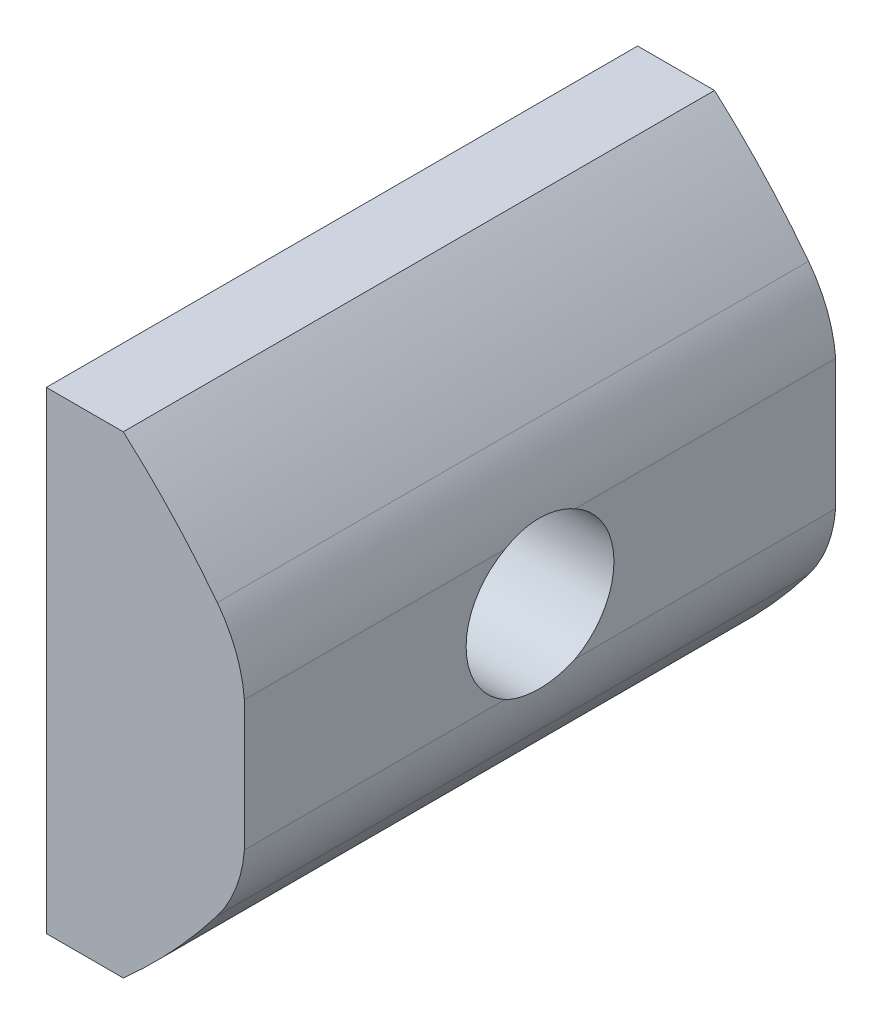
ISO-10303-21;
HEADER;
FILE_DESCRIPTION(('STEP AP214'),'2;1');
FILE_NAME('part.step','',(''),(''),'','','');
FILE_SCHEMA(('AUTOMOTIVE_DESIGN { 1 0 10303 214 1 1 1 1 }'));
ENDSEC;
DATA;
#1=APPLICATION_CONTEXT('core data for automotive mechanical design processes');
#2=APPLICATION_PROTOCOL_DEFINITION('international standard','automotive_design',2000,#1);
#3=PRODUCT_CONTEXT('',#1,'mechanical');
#4=PRODUCT('Part','Part','',(#3));
#5=PRODUCT_RELATED_PRODUCT_CATEGORY('part','',(#4));
#6=PRODUCT_DEFINITION_FORMATION('','',#4);
#7=PRODUCT_DEFINITION_CONTEXT('part definition',#1,'design');
#8=PRODUCT_DEFINITION('design','',#6,#7);
#9=PRODUCT_DEFINITION_SHAPE('','',#8);
#10=(LENGTH_UNIT() NAMED_UNIT(*) SI_UNIT(.MILLI.,.METRE.));
#11=(NAMED_UNIT(*) PLANE_ANGLE_UNIT() SI_UNIT($,.RADIAN.));
#12=(NAMED_UNIT(*) SI_UNIT($,.STERADIAN.) SOLID_ANGLE_UNIT());
#13=UNCERTAINTY_MEASURE_WITH_UNIT(LENGTH_MEASURE(1.E-05),#10,'distance_accuracy_value','');
#14=(GEOMETRIC_REPRESENTATION_CONTEXT(3) GLOBAL_UNCERTAINTY_ASSIGNED_CONTEXT((#13)) GLOBAL_UNIT_ASSIGNED_CONTEXT((#10,
#11,#12)) REPRESENTATION_CONTEXT('',''));
#15=CARTESIAN_POINT('',(0.,0.,0.));
#16=DIRECTION('',(0.,0.,1.));
#17=DIRECTION('',(1.,0.,0.));
#18=AXIS2_PLACEMENT_3D('',#15,#16,#17);
#19=CARTESIAN_POINT('',(4.,2.2,10.));
#20=DIRECTION('',(-1.,0.,0.));
#21=DIRECTION('',(0.,0.,1.));
#22=AXIS2_PLACEMENT_3D('',#19,#20,#21);
#23=PLANE('',#22);
#24=DIRECTION('',(0.,0.,-1.));
#25=VECTOR('',#24,1.);
#26=CARTESIAN_POINT('',(4.,2.2,10.));
#27=LINE('',#26,#25);
#28=CARTESIAN_POINT('',(4.,2.20000000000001,-1.18743420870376));
#29=VERTEX_POINT('',#28);
#30=CARTESIAN_POINT('',(4.,2.2,-10.));
#31=VERTEX_POINT('',#30);
#32=EDGE_CURVE('E141',#29,#31,#27,.T.);
#33=ORIENTED_EDGE('',*,*,#32,.F.);
#34=CARTESIAN_POINT('',(4.,0.,0.));
#35=DIRECTION('',(-1.,0.,0.));
#36=DIRECTION('',(0.,0.,1.));
#37=AXIS2_PLACEMENT_3D('',#34,#35,#36);
#38=CIRCLE('',#37,2.5);
#39=CARTESIAN_POINT('',(4.,-2.20000000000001,-1.18743420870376));
#40=VERTEX_POINT('',#39);
#41=EDGE_CURVE('E122',#29,#40,#38,.T.);
#42=ORIENTED_EDGE('',*,*,#41,.T.);
#43=DIRECTION('',(0.,0.,-1.));
#44=VECTOR('',#43,1.);
#45=CARTESIAN_POINT('',(4.,-2.2,10.));
#46=LINE('',#45,#44);
#47=CARTESIAN_POINT('',(4.,-2.2,-10.));
#48=VERTEX_POINT('',#47);
#49=EDGE_CURVE('E140',#40,#48,#46,.T.);
#50=ORIENTED_EDGE('',*,*,#49,.T.);
#51=DIRECTION('',(0.,1.,0.));
#52=VECTOR('',#51,1.);
#53=CARTESIAN_POINT('',(4.,2.2,-10.));
#54=LINE('',#53,#52);
#55=EDGE_CURVE('E273',#48,#31,#54,.T.);
#56=ORIENTED_EDGE('',*,*,#55,.T.);
#57=EDGE_LOOP('',(#33,#42,#50,#56));
#58=FACE_BOUND('',#57,.T.);
#59=ADVANCED_FACE('F29',(#58),#23,.F.);
#60=CARTESIAN_POINT('',(-3.,8.,10.));
#61=DIRECTION('',(0.,-1.,0.));
#62=DIRECTION('',(0.,0.,-1.));
#63=AXIS2_PLACEMENT_3D('',#60,#61,#62);
#64=PLANE('',#63);
#65=DIRECTION('',(-1.,0.,0.));
#66=VECTOR('',#65,1.);
#67=CARTESIAN_POINT('',(-3.,8.,-10.));
#68=LINE('',#67,#66);
#69=CARTESIAN_POINT('',(-0.0973372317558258,8.,-10.));
#70=VERTEX_POINT('',#69);
#71=CARTESIAN_POINT('',(-2.7,8.,-10.));
#72=VERTEX_POINT('',#71);
#73=EDGE_CURVE('E260',#70,#72,#68,.T.);
#74=ORIENTED_EDGE('',*,*,#73,.T.);
#75=DIRECTION('',(0.,0.,1.));
#76=VECTOR('',#75,1.);
#77=CARTESIAN_POINT('',(-2.7,8.,10.));
#78=LINE('',#77,#76);
#79=CARTESIAN_POINT('',(-2.7,8.,10.));
#80=VERTEX_POINT('',#79);
#81=EDGE_CURVE('E163',#72,#80,#78,.T.);
#82=ORIENTED_EDGE('',*,*,#81,.T.);
#83=DIRECTION('',(-1.,0.,0.));
#84=VECTOR('',#83,1.);
#85=CARTESIAN_POINT('',(-3.,8.,10.));
#86=LINE('',#85,#84);
#87=CARTESIAN_POINT('',(-0.0973372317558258,8.,10.));
#88=VERTEX_POINT('',#87);
#89=EDGE_CURVE('E280',#88,#80,#86,.T.);
#90=ORIENTED_EDGE('',*,*,#89,.F.);
#91=DIRECTION('',(0.,0.,-1.));
#92=VECTOR('',#91,1.);
#93=CARTESIAN_POINT('',(-0.0973372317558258,8.,10.));
#94=LINE('',#93,#92);
#95=EDGE_CURVE('E293',#88,#70,#94,.T.);
#96=ORIENTED_EDGE('',*,*,#95,.T.);
#97=EDGE_LOOP('',(#74,#82,#90,#96));
#98=FACE_BOUND('',#97,.T.);
#99=ADVANCED_FACE('F31',(#98),#64,.F.);
#100=CARTESIAN_POINT('',(-3.,8.,10.));
#101=DIRECTION('',(1.,0.,0.));
#102=DIRECTION('',(0.,0.,-1.));
#103=AXIS2_PLACEMENT_3D('',#100,#101,#102);
#104=PLANE('',#103);
#105=CARTESIAN_POINT('',(-3.,0.,0.));
#106=DIRECTION('',(-1.,0.,0.));
#107=DIRECTION('',(0.,0.,1.));
#108=AXIS2_PLACEMENT_3D('',#105,#106,#107);
#109=CIRCLE('',#108,2.5);
#110=CARTESIAN_POINT('',(-3.,0.,2.5));
#111=VERTEX_POINT('',#110);
#112=EDGE_CURVE('E240',#111,#111,#109,.T.);
#113=ORIENTED_EDGE('',*,*,#112,.F.);
#114=EDGE_LOOP('',(#113));
#115=FACE_BOUND('',#114,.T.);
#116=DIRECTION('',(0.,1.,0.));
#117=VECTOR('',#116,1.);
#118=CARTESIAN_POINT('',(-3.,8.,9.7));
#119=LINE('',#118,#117);
#120=CARTESIAN_POINT('',(-3.,-7.7,9.7));
#121=VERTEX_POINT('',#120);
#122=CARTESIAN_POINT('',(-3.,7.7,9.7));
#123=VERTEX_POINT('',#122);
#124=EDGE_CURVE('E158',#121,#123,#119,.T.);
#125=ORIENTED_EDGE('',*,*,#124,.T.);
#126=DIRECTION('',(0.,0.,-1.));
#127=VECTOR('',#126,1.);
#128=CARTESIAN_POINT('',(-3.,7.7,10.));
#129=LINE('',#128,#127);
#130=CARTESIAN_POINT('',(-3.,7.7,-9.7));
#131=VERTEX_POINT('',#130);
#132=EDGE_CURVE('E160',#123,#131,#129,.T.);
#133=ORIENTED_EDGE('',*,*,#132,.T.);
#134=DIRECTION('',(0.,-1.,0.));
#135=VECTOR('',#134,1.);
#136=CARTESIAN_POINT('',(-3.,8.,-9.7));
#137=LINE('',#136,#135);
#138=CARTESIAN_POINT('',(-3.,-7.7,-9.7));
#139=VERTEX_POINT('',#138);
#140=EDGE_CURVE('E154',#131,#139,#137,.T.);
#141=ORIENTED_EDGE('',*,*,#140,.T.);
#142=DIRECTION('',(0.,0.,1.));
#143=VECTOR('',#142,1.);
#144=CARTESIAN_POINT('',(-3.,-7.7,10.));
#145=LINE('',#144,#143);
#146=EDGE_CURVE('E156',#139,#121,#145,.T.);
#147=ORIENTED_EDGE('',*,*,#146,.T.);
#148=EDGE_LOOP('',(#125,#133,#141,#147));
#149=FACE_BOUND('',#148,.T.);
#150=ADVANCED_FACE('F214',(#115,#149),#104,.F.);
#151=CARTESIAN_POINT('',(-3.,-8.,10.));
#152=DIRECTION('',(0.,1.,0.));
#153=DIRECTION('',(0.,0.,1.));
#154=AXIS2_PLACEMENT_3D('',#151,#152,#153);
#155=PLANE('',#154);
#156=DIRECTION('',(1.,0.,0.));
#157=VECTOR('',#156,1.);
#158=CARTESIAN_POINT('',(-3.,-8.,10.));
#159=LINE('',#158,#157);
#160=CARTESIAN_POINT('',(-2.7,-8.,10.));
#161=VERTEX_POINT('',#160);
#162=CARTESIAN_POINT('',(-0.0973372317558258,-8.,10.));
#163=VERTEX_POINT('',#162);
#164=EDGE_CURVE('E283',#161,#163,#159,.T.);
#165=ORIENTED_EDGE('',*,*,#164,.F.);
#166=DIRECTION('',(0.,0.,-1.));
#167=VECTOR('',#166,1.);
#168=CARTESIAN_POINT('',(-2.7,-8.,10.));
#169=LINE('',#168,#167);
#170=CARTESIAN_POINT('',(-2.7,-8.,-10.));
#171=VERTEX_POINT('',#170);
#172=EDGE_CURVE('E55',#161,#171,#169,.T.);
#173=ORIENTED_EDGE('',*,*,#172,.T.);
#174=DIRECTION('',(1.,0.,0.));
#175=VECTOR('',#174,1.);
#176=CARTESIAN_POINT('',(-3.,-8.,-10.));
#177=LINE('',#176,#175);
#178=CARTESIAN_POINT('',(-0.0973372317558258,-8.,-10.));
#179=VERTEX_POINT('',#178);
#180=EDGE_CURVE('E263',#171,#179,#177,.T.);
#181=ORIENTED_EDGE('',*,*,#180,.T.);
#182=DIRECTION('',(0.,0.,-1.));
#183=VECTOR('',#182,1.);
#184=CARTESIAN_POINT('',(-0.0973372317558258,-8.,10.));
#185=LINE('',#184,#183);
#186=EDGE_CURVE('E151',#163,#179,#185,.T.);
#187=ORIENTED_EDGE('',*,*,#186,.F.);
#188=EDGE_LOOP('',(#165,#173,#181,#187));
#189=FACE_BOUND('',#188,.T.);
#190=ADVANCED_FACE('F226',(#189),#155,.F.);
#191=CARTESIAN_POINT('',(-16.3500000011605,10.3330562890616,10.));
#192=DIRECTION('',(0.,0.,-1.));
#193=DIRECTION('',(-1.,0.,0.));
#194=AXIS2_PLACEMENT_3D('',#191,#192,#193);
#195=CYLINDRICAL_SURFACE('',#194,24.4999999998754);
#196=CARTESIAN_POINT('',(-16.3500000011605,10.3330562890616,-10.));
#197=DIRECTION('',(0.,0.,1.));
#198=DIRECTION('',(-1.,0.,0.));
#199=AXIS2_PLACEMENT_3D('',#196,#197,#198);
#200=CIRCLE('',#199,24.4999999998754);
#201=CARTESIAN_POINT('',(3.08330765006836,-4.58661373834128,-10.));
#202=VERTEX_POINT('',#201);
#203=EDGE_CURVE('E268',#179,#202,#200,.T.);
#204=ORIENTED_EDGE('',*,*,#203,.T.);
#205=DIRECTION('',(0.,0.,-1.));
#206=VECTOR('',#205,1.);
#207=CARTESIAN_POINT('',(3.08330765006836,-4.58661373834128,10.));
#208=LINE('',#207,#206);
#209=CARTESIAN_POINT('',(3.08330765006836,-4.58661373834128,10.));
#210=VERTEX_POINT('',#209);
#211=EDGE_CURVE('E148',#210,#202,#208,.T.);
#212=ORIENTED_EDGE('',*,*,#211,.F.);
#213=CARTESIAN_POINT('',(-16.3500000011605,10.3330562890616,10.));
#214=DIRECTION('',(0.,0.,1.));
#215=DIRECTION('',(-1.,0.,0.));
#216=AXIS2_PLACEMENT_3D('',#213,#214,#215);
#217=CIRCLE('',#216,24.4999999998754);
#218=EDGE_CURVE('E285',#163,#210,#217,.T.);
#219=ORIENTED_EDGE('',*,*,#218,.F.);
#220=ORIENTED_EDGE('',*,*,#186,.T.);
#221=EDGE_LOOP('',(#204,#212,#219,#220));
#222=FACE_BOUND('',#221,.T.);
#223=ADVANCED_FACE('F221',(#222),#195,.T.);
#224=CARTESIAN_POINT('',(-0.486075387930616,-1.84626618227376,10.));
#225=DIRECTION('',(0.,0.,-1.));
#226=DIRECTION('',(-1.,0.,0.));
#227=AXIS2_PLACEMENT_3D('',#224,#225,#226);
#228=CYLINDRICAL_SURFACE('',#227,4.5);
#229=ORIENTED_EDGE('',*,*,#49,.F.);
#230=CARTESIAN_POINT('',(3.61774005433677,0.,2.5));
#231=CARTESIAN_POINT('',(3.58399671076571,0.0750027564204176,2.50000013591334));
#232=CARTESIAN_POINT('',(3.54818944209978,0.149082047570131,2.49662026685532));
#233=CARTESIAN_POINT('',(3.4728081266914,0.294758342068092,2.48364134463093));
#234=CARTESIAN_POINT('',(3.43323168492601,0.366353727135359,2.47403831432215));
#235=CARTESIAN_POINT('',(3.30924440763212,0.576966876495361,2.4366883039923));
#236=CARTESIAN_POINT('',(3.2197044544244,0.711527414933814,2.4004045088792));
#237=CARTESIAN_POINT('',(3.00644665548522,0.998355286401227,2.29826500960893));
#238=CARTESIAN_POINT('',(2.87980218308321,1.14653933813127,2.22726129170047));
#239=CARTESIAN_POINT('',(2.61545423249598,1.41973365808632,2.06392073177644));
#240=CARTESIAN_POINT('',(2.47772610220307,1.54469010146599,1.97153542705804));
#241=CARTESIAN_POINT('',(2.24480976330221,1.7323157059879,1.80523741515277));
#242=CARTESIAN_POINT('',(2.15142435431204,1.80156167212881,1.73602190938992));
#243=CARTESIAN_POINT('',(1.96297176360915,1.93066459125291,1.59121224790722));
#244=CARTESIAN_POINT('',(1.86790348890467,1.99051517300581,1.51561381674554));
#245=CARTESIAN_POINT('',(1.67777220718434,2.10086176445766,1.3585181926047));
#246=CARTESIAN_POINT('',(1.58270989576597,2.15138289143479,1.27703768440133));
#247=CARTESIAN_POINT('',(1.39423187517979,2.24340000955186,1.10747131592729));
#248=CARTESIAN_POINT('',(1.30081446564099,2.28490589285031,1.01939283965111));
#249=CARTESIAN_POINT('',(1.15712646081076,2.34338518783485,0.872872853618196));
#250=CARTESIAN_POINT('',(1.10508906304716,2.36337668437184,0.817364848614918));
#251=CARTESIAN_POINT('',(1.00427984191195,2.40010871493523,0.702242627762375));
#252=CARTESIAN_POINT('',(0.955511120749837,2.41684618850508,0.642624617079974));
#253=CARTESIAN_POINT('',(0.872669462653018,2.44387935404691,0.529333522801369));
#254=CARTESIAN_POINT('',(0.837544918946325,2.4547937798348,0.476591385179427));
#255=CARTESIAN_POINT('',(0.774673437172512,2.47363878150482,0.366351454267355));
#256=CARTESIAN_POINT('',(0.746899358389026,2.48158038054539,0.308872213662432));
#257=CARTESIAN_POINT('',(0.712256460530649,2.4912673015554,0.212023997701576));
#258=CARTESIAN_POINT('',(0.701456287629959,2.49422110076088,0.174221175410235));
#259=CARTESIAN_POINT('',(0.686073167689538,2.49840106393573,0.0973003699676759));
#260=CARTESIAN_POINT('',(0.681476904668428,2.49963092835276,0.0581853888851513));
#261=CARTESIAN_POINT('',(0.679258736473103,2.5002265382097,-0.0204318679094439));
#262=CARTESIAN_POINT('',(0.681666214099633,2.49958443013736,-0.0599350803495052));
#263=CARTESIAN_POINT('',(0.693083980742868,2.49649965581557,-0.137912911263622));
#264=CARTESIAN_POINT('',(0.702104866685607,2.49405409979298,-0.176385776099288));
#265=CARTESIAN_POINT('',(0.730604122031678,2.48616817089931,-0.268215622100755));
#266=CARTESIAN_POINT('',(0.752948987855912,2.47987962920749,-0.320583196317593));
#267=CARTESIAN_POINT('',(0.80458016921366,2.46475880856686,-0.421407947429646));
#268=CARTESIAN_POINT('',(0.833894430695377,2.45591625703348,-0.469848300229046));
#269=CARTESIAN_POINT('',(0.91060974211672,2.43176055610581,-0.584225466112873));
#270=CARTESIAN_POINT('',(0.960262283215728,2.41531767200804,-0.648380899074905));
#271=CARTESIAN_POINT('',(1.06398048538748,2.37870555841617,-0.771950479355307));
#272=CARTESIAN_POINT('',(1.11805569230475,2.3585281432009,-0.831353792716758));
#273=CARTESIAN_POINT('',(1.22883529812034,2.31458124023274,-0.946861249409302));
#274=CARTESIAN_POINT('',(1.28555172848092,2.29079391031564,-1.00294696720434));
#275=CARTESIAN_POINT('',(1.40016747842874,2.23981103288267,-1.11214614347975));
#276=CARTESIAN_POINT('',(1.45806573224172,2.21261845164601,-1.16526213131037));
#277=CARTESIAN_POINT('',(1.61147406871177,2.13639367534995,-1.30203111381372));
#278=CARTESIAN_POINT('',(1.70744800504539,2.08448410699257,-1.38358175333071));
#279=CARTESIAN_POINT('',(1.89900388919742,1.97129932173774,-1.54056269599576));
#280=CARTESIAN_POINT('',(1.99458549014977,1.91001712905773,-1.61598837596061));
#281=CARTESIAN_POINT('',(2.18362975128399,1.77808260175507,-1.76009227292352));
#282=CARTESIAN_POINT('',(2.27709925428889,1.70746797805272,-1.82879580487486));
#283=CARTESIAN_POINT('',(2.4611042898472,1.55642499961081,-1.95894793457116));
#284=CARTESIAN_POINT('',(2.55164017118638,1.47599781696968,-2.02039739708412));
#285=CARTESIAN_POINT('',(2.75747393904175,1.27719000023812,-2.15345967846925));
#286=CARTESIAN_POINT('',(2.87122849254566,1.15498146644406,-2.22186042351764));
#287=CARTESIAN_POINT('',(3.08809241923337,0.893104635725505,-2.33942704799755));
#288=CARTESIAN_POINT('',(3.19121439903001,0.753457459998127,-2.38861590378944));
#289=CARTESIAN_POINT('',(3.36495257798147,0.486103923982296,-2.45538309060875));
#290=CARTESIAN_POINT('',(3.43803431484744,0.361093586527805,-2.47716735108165));
#291=CARTESIAN_POINT('',(3.53877042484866,0.167668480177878,-2.49521414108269));
#292=CARTESIAN_POINT('',(3.57087580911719,0.102189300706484,-2.49879041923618));
#293=CARTESIAN_POINT('',(3.63188460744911,-0.0303057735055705,-2.50069283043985));
#294=CARTESIAN_POINT('',(3.6607894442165,-0.0973209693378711,-2.49902130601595));
#295=CARTESIAN_POINT('',(3.71540116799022,-0.23289130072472,-2.49006279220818));
#296=CARTESIAN_POINT('',(3.74108124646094,-0.301454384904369,-2.48273194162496));
#297=CARTESIAN_POINT('',(3.78881326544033,-0.438921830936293,-2.46214854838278));
#298=CARTESIAN_POINT('',(3.81086695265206,-0.507826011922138,-2.44889886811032));
#299=CARTESIAN_POINT('',(3.85129108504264,-0.645275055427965,-2.41632033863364));
#300=CARTESIAN_POINT('',(3.86966205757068,-0.713819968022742,-2.39699236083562));
#301=CARTESIAN_POINT('',(3.90276096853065,-0.849762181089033,-2.35224029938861));
#302=CARTESIAN_POINT('',(3.91748930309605,-0.91715960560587,-2.326816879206));
#303=CARTESIAN_POINT('',(3.95330568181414,-1.10058786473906,-2.24829675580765));
#304=CARTESIAN_POINT('',(3.97073398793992,-1.21469822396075,-2.18884337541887));
#305=CARTESIAN_POINT('',(3.9962662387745,-1.43304738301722,-2.05255299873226));
#306=CARTESIAN_POINT('',(4.00436993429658,-1.53728591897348,-1.97571553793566));
#307=CARTESIAN_POINT('',(4.01353927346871,-1.73237342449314,-1.80705171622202));
#308=CARTESIAN_POINT('',(4.01463462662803,-1.82327731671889,-1.71529032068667));
#309=CARTESIAN_POINT('',(4.01240656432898,-1.98985338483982,-1.51890730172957));
#310=CARTESIAN_POINT('',(4.00908198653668,-2.06552154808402,-1.41428230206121));
#311=CARTESIAN_POINT('',(4.0002468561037,-2.20411063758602,-1.18769907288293));
#312=CARTESIAN_POINT('',(3.99461077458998,-2.2659154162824,-1.06506177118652));
#313=CARTESIAN_POINT('',(3.98380084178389,-2.36865350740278,-0.811309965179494));
#314=CARTESIAN_POINT('',(3.97862704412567,-2.40958440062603,-0.680194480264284));
#315=CARTESIAN_POINT('',(3.97056026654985,-2.47026777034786,-0.409326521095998));
#316=CARTESIAN_POINT('',(3.96773272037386,-2.48941786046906,-0.26943638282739));
#317=CARTESIAN_POINT('',(3.96561372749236,-2.5039293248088,0.0115916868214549));
#318=CARTESIAN_POINT('',(3.96632207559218,-2.49929207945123,0.15272954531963));
#319=CARTESIAN_POINT('',(3.97099917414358,-2.46654639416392,0.430751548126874));
#320=CARTESIAN_POINT('',(3.974935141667,-2.43867390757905,0.567664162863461));
#321=CARTESIAN_POINT('',(3.98460922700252,-2.36057516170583,0.834907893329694));
#322=CARTESIAN_POINT('',(3.99034767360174,-2.31034482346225,0.96523780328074));
#323=CARTESIAN_POINT('',(4.00131478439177,-2.18844574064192,1.2167073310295));
#324=CARTESIAN_POINT('',(4.00653926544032,-2.11661775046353,1.33776999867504));
#325=CARTESIAN_POINT('',(4.0133810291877,-1.95361538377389,1.56622763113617));
#326=CARTESIAN_POINT('',(4.01499853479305,-1.86244220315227,1.67362344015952));
#327=CARTESIAN_POINT('',(4.01132221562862,-1.66422514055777,1.87075505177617));
#328=CARTESIAN_POINT('',(4.00608513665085,-1.55731798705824,1.96062886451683));
#329=CARTESIAN_POINT('',(3.9857302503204,-1.33065818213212,2.12098768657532));
#330=CARTESIAN_POINT('',(3.97061661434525,-1.21091097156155,2.19148086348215));
#331=CARTESIAN_POINT('',(3.9295044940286,-0.970711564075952,2.3074734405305));
#332=CARTESIAN_POINT('',(3.90422008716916,-0.850740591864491,2.35422723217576));
#333=CARTESIAN_POINT('',(3.84200088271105,-0.607962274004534,2.42826019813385));
#334=CARTESIAN_POINT('',(3.80507995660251,-0.48515846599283,2.4555624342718));
#335=CARTESIAN_POINT('',(3.74113722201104,-0.301950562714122,2.48247314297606));
#336=CARTESIAN_POINT('',(3.71836236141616,-0.240972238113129,2.48910240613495));
#337=CARTESIAN_POINT('',(3.67007212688,-0.119801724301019,2.49786482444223));
#338=CARTESIAN_POINT('',(3.64455792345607,-0.0596092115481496,2.49999989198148));
#339=CARTESIAN_POINT('',(3.61774005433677,0.,2.5));
#340=B_SPLINE_CURVE_WITH_KNOTS('',3,(#230,#231,#232,#233,#234,#235,#236,#237,#238,#239,#240,
#241,#242,#243,#244,#245,#246,#247,#248,#249,#250,#251,#252,#253,#254,#255,#256,#257,#258,#259,
#260,#261,#262,#263,#264,#265,#266,#267,#268,#269,#270,#271,#272,#273,#274,#275,#276,#277,#278,
#279,#280,#281,#282,#283,#284,#285,#286,#287,#288,#289,#290,#291,#292,#293,#294,#295,#296,#297,
#298,#299,#300,#301,#302,#303,#304,#305,#306,#307,#308,#309,#310,#311,#312,#313,#314,#315,#316,
#317,#318,#319,#320,#321,#322,#323,#324,#325,#326,#327,#328,#329,#330,#331,#332,#333,#334,#335,
#336,#337,#338,#339),.UNSPECIFIED.,.T.,.F.,(4,2,2,2,2,2,2,2,2,2,2,2,2,2,2,2,2,2,2,2,2,2,2,2,2,2,
2,2,2,2,2,2,2,2,2,2,2,2,2,2,2,2,2,2,2,2,2,2,2,2,2,2,2,2,4),(0.,0.246644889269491,
0.493447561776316,0.987975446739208,1.60712693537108,2.22769575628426,2.63315618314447,
3.03889038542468,3.44351579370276,3.84769495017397,4.08355077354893,4.31962736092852,
4.51217175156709,4.70399494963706,4.82182892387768,4.93940957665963,5.05748422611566,
5.17574848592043,5.34660518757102,5.51815890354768,5.76588563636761,6.0141619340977,
6.26370791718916,6.51303801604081,6.92120217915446,7.32967161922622,7.73653827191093,
8.14335637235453,8.68272537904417,9.22144734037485,9.65882046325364,9.87762990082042,
10.096341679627,10.3167657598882,10.5370833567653,10.7573693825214,10.9776314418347,
11.3651005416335,11.7525799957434,12.1384157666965,12.52435302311,12.934824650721,
13.3453438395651,13.7669598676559,14.1885514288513,14.6059131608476,15.023351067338,
15.4439456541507,15.8645142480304,16.2816230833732,16.69855586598,17.0902568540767,
17.4814926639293,17.6775996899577,17.8736232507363),.UNSPECIFIED.);
#341=CARTESIAN_POINT('',(4.,-2.2,1.18743420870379));
#342=VERTEX_POINT('',#341);
#343=EDGE_CURVE('E11',#40,#342,#340,.T.);
#344=ORIENTED_EDGE('',*,*,#343,.T.);
#345=CARTESIAN_POINT('',(4.,-2.2,10.));
#346=VERTEX_POINT('',#345);
#347=EDGE_CURVE('E135',#346,#342,#46,.T.);
#348=ORIENTED_EDGE('',*,*,#347,.F.);
#349=CARTESIAN_POINT('',(-0.486075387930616,-1.84626618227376,10.));
#350=DIRECTION('',(0.,0.,1.));
#351=DIRECTION('',(-1.,0.,0.));
#352=AXIS2_PLACEMENT_3D('',#349,#350,#351);
#353=CIRCLE('',#352,4.5);
#354=EDGE_CURVE('E287',#210,#346,#353,.T.);
#355=ORIENTED_EDGE('',*,*,#354,.F.);
#356=ORIENTED_EDGE('',*,*,#211,.T.);
#357=CARTESIAN_POINT('',(-0.486075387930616,-1.84626618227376,-10.));
#358=DIRECTION('',(0.,0.,1.));
#359=DIRECTION('',(-1.,0.,0.));
#360=AXIS2_PLACEMENT_3D('',#357,#358,#359);
#361=CIRCLE('',#360,4.5);
#362=EDGE_CURVE('E270',#202,#48,#361,.T.);
#363=ORIENTED_EDGE('',*,*,#362,.T.);
#364=EDGE_LOOP('',(#229,#344,#348,#355,#356,#363));
#365=FACE_BOUND('',#364,.T.);
#366=ADVANCED_FACE('F217',(#365),#228,.T.);
#367=ORIENTED_EDGE('',*,*,#347,.T.);
#368=CARTESIAN_POINT('',(4.,2.20000000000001,1.18743420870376));
#369=VERTEX_POINT('',#368);
#370=EDGE_CURVE('E48',#342,#369,#38,.T.);
#371=ORIENTED_EDGE('',*,*,#370,.T.);
#372=CARTESIAN_POINT('',(4.,2.2,10.));
#373=VERTEX_POINT('',#372);
#374=EDGE_CURVE('E132',#373,#369,#27,.T.);
#375=ORIENTED_EDGE('',*,*,#374,.F.);
#376=DIRECTION('',(0.,1.,0.));
#377=VECTOR('',#376,1.);
#378=CARTESIAN_POINT('',(4.,2.2,10.));
#379=LINE('',#378,#377);
#380=EDGE_CURVE('E289',#346,#373,#379,.T.);
#381=ORIENTED_EDGE('',*,*,#380,.F.);
#382=EDGE_LOOP('',(#367,#371,#375,#381));
#383=FACE_BOUND('',#382,.T.);
#384=ADVANCED_FACE('F130',(#383),#23,.F.);
#385=CARTESIAN_POINT('',(-0.486075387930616,1.84626618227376,10.));
#386=DIRECTION('',(0.,0.,-1.));
#387=DIRECTION('',(-1.,0.,0.));
#388=AXIS2_PLACEMENT_3D('',#385,#386,#387);
#389=CYLINDRICAL_SURFACE('',#388,4.5);
#390=ORIENTED_EDGE('',*,*,#374,.T.);
#391=CARTESIAN_POINT('',(3.61774005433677,0.,2.5));
#392=CARTESIAN_POINT('',(3.67107078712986,0.118555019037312,2.49999445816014));
#393=CARTESIAN_POINT('',(3.71927119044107,0.239513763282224,2.49153445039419));
#394=CARTESIAN_POINT('',(3.80431427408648,0.482755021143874,2.45602331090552));
#395=CARTESIAN_POINT('',(3.84115513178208,0.605037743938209,2.42896919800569));
#396=CARTESIAN_POINT('',(3.90335280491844,0.84699000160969,2.35554911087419));
#397=CARTESIAN_POINT('',(3.92868791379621,0.966654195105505,2.3091469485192));
#398=CARTESIAN_POINT('',(3.96866335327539,1.19881119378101,2.19759906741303));
#399=CARTESIAN_POINT('',(3.98330277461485,1.31130338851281,2.13245175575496));
#400=CARTESIAN_POINT('',(4.00350003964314,1.52265088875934,1.98685799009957));
#401=CARTESIAN_POINT('',(4.00927228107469,1.62177344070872,1.90682698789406));
#402=CARTESIAN_POINT('',(4.01470485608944,1.80678433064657,1.73253993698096));
#403=CARTESIAN_POINT('',(4.01436369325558,1.89266942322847,1.63828041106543));
#404=CARTESIAN_POINT('',(4.00991820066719,2.05327666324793,1.43247777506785));
#405=CARTESIAN_POINT('',(4.0056129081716,2.12715243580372,1.32027861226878));
#406=CARTESIAN_POINT('',(3.99569985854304,2.25599708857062,1.08554770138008));
#407=CARTESIAN_POINT('',(3.99009180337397,2.31096163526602,0.96301359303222));
#408=CARTESIAN_POINT('',(3.979640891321,2.40271049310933,0.704719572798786));
#409=CARTESIAN_POINT('',(3.97484652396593,2.43851644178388,0.568608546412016));
#410=CARTESIAN_POINT('',(3.96816940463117,2.48681867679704,0.292247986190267));
#411=CARTESIAN_POINT('',(3.96628644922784,2.49931659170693,0.151998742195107));
#412=CARTESIAN_POINT('',(3.96609408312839,2.50062626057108,-0.12808730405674));
#413=CARTESIAN_POINT('',(3.96777131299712,2.48952656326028,-0.267923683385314));
#414=CARTESIAN_POINT('',(3.97408621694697,2.44415684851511,-0.543721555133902));
#415=CARTESIAN_POINT('',(3.97872419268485,2.40988447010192,-0.679682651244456));
#416=CARTESIAN_POINT('',(3.98923418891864,2.31920386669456,-0.943808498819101));
#417=CARTESIAN_POINT('',(3.99510504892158,2.26281641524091,-1.07198043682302));
#418=CARTESIAN_POINT('',(4.00550316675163,2.12942737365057,-1.31720237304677));
#419=CARTESIAN_POINT('',(4.01003023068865,2.05242281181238,-1.43425076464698));
#420=CARTESIAN_POINT('',(4.01463904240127,1.87933553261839,-1.65464499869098));
#421=CARTESIAN_POINT('',(4.01469212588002,1.78313375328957,-1.75789825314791));
#422=CARTESIAN_POINT('',(4.00693939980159,1.5749139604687,-1.94662811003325));
#423=CARTESIAN_POINT('',(3.9991374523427,1.46290374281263,-2.03211342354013));
#424=CARTESIAN_POINT('',(3.97330034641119,1.2324493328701,-2.17919432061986));
#425=CARTESIAN_POINT('',(3.95575136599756,1.11453649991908,-2.2417063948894));
#426=CARTESIAN_POINT('',(3.90898326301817,0.872283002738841,-2.34659920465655));
#427=CARTESIAN_POINT('',(3.87976897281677,0.747945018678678,-2.38898826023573));
#428=CARTESIAN_POINT('',(3.81089539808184,0.504161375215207,-2.45170110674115));
#429=CARTESIAN_POINT('',(3.7718660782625,0.384802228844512,-2.47306789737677));
#430=CARTESIAN_POINT('',(3.68317875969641,0.14824060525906,-2.49843744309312));
#431=CARTESIAN_POINT('',(3.63351809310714,0.0310386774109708,-2.5024358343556));
#432=CARTESIAN_POINT('',(3.52196301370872,-0.203948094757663,-2.49457685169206));
#433=CARTESIAN_POINT('',(3.45958319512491,-0.321472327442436,-2.48192144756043));
#434=CARTESIAN_POINT('',(3.32600348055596,-0.548616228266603,-2.44179116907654));
#435=CARTESIAN_POINT('',(3.2548007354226,-0.658233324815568,-2.41431149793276));
#436=CARTESIAN_POINT('',(3.06768105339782,-0.921092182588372,-2.33003244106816));
#437=CARTESIAN_POINT('',(2.94725141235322,-1.06863329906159,-2.26544016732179));
#438=CARTESIAN_POINT('',(2.69501377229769,-1.34207140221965,-2.11502825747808));
#439=CARTESIAN_POINT('',(2.56316638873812,-1.46788859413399,-2.02913307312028));
#440=CARTESIAN_POINT('',(2.33792375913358,-1.65929787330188,-1.87255795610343));
#441=CARTESIAN_POINT('',(2.24641836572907,-1.73095770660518,-1.80639906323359));
#442=CARTESIAN_POINT('',(2.06138205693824,-1.86500190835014,-1.66765828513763));
#443=CARTESIAN_POINT('',(1.96784998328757,-1.92738080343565,-1.59507264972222));
#444=CARTESIAN_POINT('',(1.7803746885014,-2.04285759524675,-1.44420475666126));
#445=CARTESIAN_POINT('',(1.68643416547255,-2.09598814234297,-1.36594398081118));
#446=CARTESIAN_POINT('',(1.49938039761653,-2.19341687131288,-1.2032980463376));
#447=CARTESIAN_POINT('',(1.40626653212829,-2.23772233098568,-1.11891801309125));
#448=CARTESIAN_POINT('',(1.25585920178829,-2.30341182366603,-0.973755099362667));
#449=CARTESIAN_POINT('',(1.19754526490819,-2.32736030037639,-0.915182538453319));
#450=CARTESIAN_POINT('',(1.08349011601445,-2.37157799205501,-0.793612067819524));
#451=CARTESIAN_POINT('',(1.02776246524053,-2.39182915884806,-0.730594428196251));
#452=CARTESIAN_POINT('',(0.920949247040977,-2.42848538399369,-0.597777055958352));
#453=CARTESIAN_POINT('',(0.869958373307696,-2.44481943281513,-0.527880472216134));
#454=CARTESIAN_POINT('',(0.78029614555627,-2.47211922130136,-0.379707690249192));
#455=CARTESIAN_POINT('',(0.741500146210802,-2.48313993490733,-0.301527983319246));
#456=CARTESIAN_POINT('',(0.703281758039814,-2.49373422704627,-0.180921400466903));
#457=CARTESIAN_POINT('',(0.693913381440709,-2.49627510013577,-0.142039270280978));
#458=CARTESIAN_POINT('',(0.681939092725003,-2.49951117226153,-0.0631911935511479));
#459=CARTESIAN_POINT('',(0.679320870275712,-2.50020973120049,-0.0232273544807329));
#460=CARTESIAN_POINT('',(0.681297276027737,-2.49967926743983,0.0565440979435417));
#461=CARTESIAN_POINT('',(0.685899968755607,-2.49844808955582,0.0963514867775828));
#462=CARTESIAN_POINT('',(0.701517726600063,-2.49420443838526,0.174611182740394));
#463=CARTESIAN_POINT('',(0.712546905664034,-2.49118804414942,0.213060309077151));
#464=CARTESIAN_POINT('',(0.747100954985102,-2.4815209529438,0.309069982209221));
#465=CARTESIAN_POINT('',(0.774164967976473,-2.47378031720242,0.365210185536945));
#466=CARTESIAN_POINT('',(0.83536366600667,-2.45545810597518,0.473007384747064));
#467=CARTESIAN_POINT('',(0.869527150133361,-2.44486490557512,0.524644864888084));
#468=CARTESIAN_POINT('',(0.960100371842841,-2.41540275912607,0.649437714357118));
#469=CARTESIAN_POINT('',(1.01905887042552,-2.39505078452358,0.720358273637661));
#470=CARTESIAN_POINT('',(1.14130667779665,-2.34967598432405,0.856844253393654));
#471=CARTESIAN_POINT('',(1.20460503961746,-2.32464319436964,0.922397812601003));
#472=CARTESIAN_POINT('',(1.33360216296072,-2.27000652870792,1.04970612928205));
#473=CARTESIAN_POINT('',(1.39931011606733,-2.2403833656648,1.11144324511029));
#474=CARTESIAN_POINT('',(1.53159276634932,-2.1767187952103,1.23146275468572));
#475=CARTESIAN_POINT('',(1.59816668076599,-2.14268115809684,1.28974803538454));
#476=CARTESIAN_POINT('',(1.75732848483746,-2.05606908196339,1.42524386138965));
#477=CARTESIAN_POINT('',(1.85000408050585,-2.00142143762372,1.50103992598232));
#478=CARTESIAN_POINT('',(2.0343625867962,-1.88326457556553,1.64685056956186));
#479=CARTESIAN_POINT('',(2.12604486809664,-1.81975005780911,1.71686165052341));
#480=CARTESIAN_POINT('',(2.30695301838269,-1.68385321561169,1.85031709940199));
#481=CARTESIAN_POINT('',(2.39618650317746,-1.61150343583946,1.91378406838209));
#482=CARTESIAN_POINT('',(2.57144806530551,-1.45754316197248,2.03348751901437));
#483=CARTESIAN_POINT('',(2.65747666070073,-1.37593417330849,2.08972517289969));
#484=CARTESIAN_POINT('',(2.85144401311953,-1.17630115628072,2.2099366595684));
#485=CARTESIAN_POINT('',(2.95783562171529,-1.05486378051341,2.27084224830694));
#486=CARTESIAN_POINT('',(3.15994949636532,-0.796321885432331,2.37384417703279));
#487=CARTESIAN_POINT('',(3.25569646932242,-0.659255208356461,2.41598478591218));
#488=CARTESIAN_POINT('',(3.39493401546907,-0.433443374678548,2.46356437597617));
#489=CARTESIAN_POINT('',(3.44318954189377,-0.349267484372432,2.47699328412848));
#490=CARTESIAN_POINT('',(3.53451411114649,-0.177182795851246,2.49521448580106));
#491=CARTESIAN_POINT('',(3.57758158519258,-0.0892728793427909,2.50000417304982));
#492=CARTESIAN_POINT('',(3.61774005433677,0.,2.5));
#493=B_SPLINE_CURVE_WITH_KNOTS('',3,(#391,#392,#393,#394,#395,#396,#397,#398,#399,#400,#401,
#402,#403,#404,#405,#406,#407,#408,#409,#410,#411,#412,#413,#414,#415,#416,#417,#418,#419,#420,
#421,#422,#423,#424,#425,#426,#427,#428,#429,#430,#431,#432,#433,#434,#435,#436,#437,#438,#439,
#440,#441,#442,#443,#444,#445,#446,#447,#448,#449,#450,#451,#452,#453,#454,#455,#456,#457,#458,
#459,#460,#461,#462,#463,#464,#465,#466,#467,#468,#469,#470,#471,#472,#473,#474,#475,#476,#477,
#478,#479,#480,#481,#482,#483,#484,#485,#486,#487,#488,#489,#490,#491,#492),.UNSPECIFIED.,.T.,
.F.,(4,2,2,2,2,2,2,2,2,2,2,2,2,2,2,2,2,2,2,2,2,2,2,2,2,2,2,2,2,2,2,2,2,2,2,2,2,2,2,2,2,2,2,2,2,
2,2,2,2,2,4),(0.,0.389677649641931,0.779417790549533,1.1698901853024,1.5603957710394,
1.94130191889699,2.32230130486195,2.72374650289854,3.12528363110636,3.54573555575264,
3.96615810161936,4.38500582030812,4.80389622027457,5.22239407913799,5.64095229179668,
6.06219195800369,6.48322461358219,6.88493046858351,7.28647008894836,7.66689677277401,
8.04741903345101,8.44685611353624,8.84642251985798,9.44642850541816,10.0485935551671,
10.4493385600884,10.8503189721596,11.2498537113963,11.6490575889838,11.9070588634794,
12.1662877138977,12.4299104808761,12.6907438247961,12.8104379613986,12.9299136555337,
13.0495228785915,13.1693957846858,13.3567218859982,13.5448232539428,13.8274997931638,
14.1107850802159,14.3952946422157,14.6795627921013,15.0739428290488,15.4685596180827,
15.8617643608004,16.2549052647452,16.77081433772,17.2854997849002,17.5788416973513,
17.8722720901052),.UNSPECIFIED.);
#494=EDGE_CURVE('E41',#369,#29,#493,.T.);
#495=ORIENTED_EDGE('',*,*,#494,.T.);
#496=ORIENTED_EDGE('',*,*,#32,.T.);
#497=CARTESIAN_POINT('',(-0.486075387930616,1.84626618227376,-10.));
#498=DIRECTION('',(0.,0.,1.));
#499=DIRECTION('',(1.,0.,0.));
#500=AXIS2_PLACEMENT_3D('',#497,#498,#499);
#501=CIRCLE('',#500,4.5);
#502=CARTESIAN_POINT('',(3.08330765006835,4.58661373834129,-10.));
#503=VERTEX_POINT('',#502);
#504=EDGE_CURVE('E276',#31,#503,#501,.T.);
#505=ORIENTED_EDGE('',*,*,#504,.T.);
#506=DIRECTION('',(0.,0.,-1.));
#507=VECTOR('',#506,1.);
#508=CARTESIAN_POINT('',(3.08330765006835,4.58661373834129,10.));
#509=LINE('',#508,#507);
#510=CARTESIAN_POINT('',(3.08330765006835,4.58661373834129,10.));
#511=VERTEX_POINT('',#510);
#512=EDGE_CURVE('E144',#511,#503,#509,.T.);
#513=ORIENTED_EDGE('',*,*,#512,.F.);
#514=CARTESIAN_POINT('',(-0.486075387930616,1.84626618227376,10.));
#515=DIRECTION('',(0.,0.,1.));
#516=DIRECTION('',(1.,0.,0.));
#517=AXIS2_PLACEMENT_3D('',#514,#515,#516);
#518=CIRCLE('',#517,4.5);
#519=EDGE_CURVE('E139',#373,#511,#518,.T.);
#520=ORIENTED_EDGE('',*,*,#519,.F.);
#521=EDGE_LOOP('',(#390,#495,#496,#505,#513,#520));
#522=FACE_BOUND('',#521,.T.);
#523=ADVANCED_FACE('F137',(#522),#389,.T.);
#524=CARTESIAN_POINT('',(-16.3500000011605,-10.3330562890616,10.));
#525=DIRECTION('',(0.,0.,-1.));
#526=DIRECTION('',(-1.,0.,0.));
#527=AXIS2_PLACEMENT_3D('',#524,#525,#526);
#528=CYLINDRICAL_SURFACE('',#527,24.4999999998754);
#529=CARTESIAN_POINT('',(-16.3500000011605,-10.3330562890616,-10.));
#530=DIRECTION('',(0.,0.,1.));
#531=DIRECTION('',(1.,0.,0.));
#532=AXIS2_PLACEMENT_3D('',#529,#530,#531);
#533=CIRCLE('',#532,24.4999999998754);
#534=EDGE_CURVE('E278',#503,#70,#533,.T.);
#535=ORIENTED_EDGE('',*,*,#534,.T.);
#536=ORIENTED_EDGE('',*,*,#95,.F.);
#537=CARTESIAN_POINT('',(-16.3500000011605,-10.3330562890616,10.));
#538=DIRECTION('',(0.,0.,1.));
#539=DIRECTION('',(1.,0.,0.));
#540=AXIS2_PLACEMENT_3D('',#537,#538,#539);
#541=CIRCLE('',#540,24.4999999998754);
#542=EDGE_CURVE('E292',#511,#88,#541,.T.);
#543=ORIENTED_EDGE('',*,*,#542,.F.);
#544=ORIENTED_EDGE('',*,*,#512,.T.);
#545=EDGE_LOOP('',(#535,#536,#543,#544));
#546=FACE_BOUND('',#545,.T.);
#547=ADVANCED_FACE('F202',(#546),#528,.T.);
#548=CARTESIAN_POINT('',(-16.3500000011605,-10.3330562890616,10.));
#549=DIRECTION('',(0.,0.,1.));
#550=DIRECTION('',(1.,0.,0.));
#551=AXIS2_PLACEMENT_3D('',#548,#549,#550);
#552=PLANE('',#551);
#553=ORIENTED_EDGE('',*,*,#89,.T.);
#554=DIRECTION('',(0.,-1.,0.));
#555=VECTOR('',#554,1.);
#556=CARTESIAN_POINT('',(-2.7,-8.,10.));
#557=LINE('',#556,#555);
#558=EDGE_CURVE('E166',#80,#161,#557,.T.);
#559=ORIENTED_EDGE('',*,*,#558,.T.);
#560=ORIENTED_EDGE('',*,*,#164,.T.);
#561=ORIENTED_EDGE('',*,*,#218,.T.);
#562=ORIENTED_EDGE('',*,*,#354,.T.);
#563=ORIENTED_EDGE('',*,*,#380,.T.);
#564=ORIENTED_EDGE('',*,*,#519,.T.);
#565=ORIENTED_EDGE('',*,*,#542,.T.);
#566=EDGE_LOOP('',(#553,#559,#560,#561,#562,#563,#564,#565));
#567=FACE_BOUND('',#566,.T.);
#568=ADVANCED_FACE('F199',(#567),#552,.T.);
#569=CARTESIAN_POINT('',(-16.3500000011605,-10.3330562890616,-10.));
#570=DIRECTION('',(0.,0.,1.));
#571=DIRECTION('',(1.,0.,0.));
#572=AXIS2_PLACEMENT_3D('',#569,#570,#571);
#573=PLANE('',#572);
#574=ORIENTED_EDGE('',*,*,#180,.F.);
#575=DIRECTION('',(0.,1.,0.));
#576=VECTOR('',#575,1.);
#577=CARTESIAN_POINT('',(-2.7,-10.3330562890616,-10.));
#578=LINE('',#577,#576);
#579=EDGE_CURVE('E126',#171,#72,#578,.T.);
#580=ORIENTED_EDGE('',*,*,#579,.T.);
#581=ORIENTED_EDGE('',*,*,#73,.F.);
#582=ORIENTED_EDGE('',*,*,#534,.F.);
#583=ORIENTED_EDGE('',*,*,#504,.F.);
#584=ORIENTED_EDGE('',*,*,#55,.F.);
#585=ORIENTED_EDGE('',*,*,#362,.F.);
#586=ORIENTED_EDGE('',*,*,#203,.F.);
#587=EDGE_LOOP('',(#574,#580,#581,#582,#583,#584,#585,#586));
#588=FACE_BOUND('',#587,.T.);
#589=ADVANCED_FACE('F195',(#588),#573,.F.);
#590=CARTESIAN_POINT('',(-2.7,-8.,10.));
#591=DIRECTION('',(0.707106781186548,0.707106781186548,0.));
#592=DIRECTION('',(-0.707106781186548,0.707106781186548,0.));
#593=AXIS2_PLACEMENT_3D('',#590,#591,#592);
#594=PLANE('',#593);
#595=DIRECTION('',(-0.577350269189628,0.577350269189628,0.577350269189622));
#596=VECTOR('',#595,1.);
#597=CARTESIAN_POINT('',(-8.23333333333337,-2.46666666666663,-4.46666666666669));
#598=LINE('',#597,#596);
#599=EDGE_CURVE('E250',#171,#139,#598,.T.);
#600=ORIENTED_EDGE('',*,*,#599,.F.);
#601=ORIENTED_EDGE('',*,*,#172,.F.);
#602=DIRECTION('',(0.577350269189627,-0.577350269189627,0.577350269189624));
#603=VECTOR('',#602,1.);
#604=CARTESIAN_POINT('',(-2.7,-8.,10.));
#605=LINE('',#604,#603);
#606=EDGE_CURVE('E259',#121,#161,#605,.T.);
#607=ORIENTED_EDGE('',*,*,#606,.F.);
#608=ORIENTED_EDGE('',*,*,#146,.F.);
#609=EDGE_LOOP('',(#600,#601,#607,#608));
#610=FACE_BOUND('',#609,.T.);
#611=ADVANCED_FACE('F191',(#610),#594,.F.);
#612=CARTESIAN_POINT('',(-2.7,-10.3330562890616,10.));
#613=DIRECTION('',(-0.707106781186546,0.,0.707106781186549));
#614=DIRECTION('',(0.707106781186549,0.,0.707106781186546));
#615=AXIS2_PLACEMENT_3D('',#612,#613,#614);
#616=PLANE('',#615);
#617=ORIENTED_EDGE('',*,*,#606,.T.);
#618=ORIENTED_EDGE('',*,*,#558,.F.);
#619=DIRECTION('',(0.577350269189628,0.577350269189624,0.577350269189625));
#620=VECTOR('',#619,1.);
#621=CARTESIAN_POINT('',(-8.81101876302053,1.8889812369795,3.88898123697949));
#622=LINE('',#621,#620);
#623=EDGE_CURVE('E248',#123,#80,#622,.T.);
#624=ORIENTED_EDGE('',*,*,#623,.F.);
#625=ORIENTED_EDGE('',*,*,#124,.F.);
#626=EDGE_LOOP('',(#617,#618,#624,#625));
#627=FACE_BOUND('',#626,.T.);
#628=ADVANCED_FACE('F187',(#627),#616,.T.);
#629=CARTESIAN_POINT('',(-3.,8.,-9.7));
#630=DIRECTION('',(0.707106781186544,0.,0.707106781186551));
#631=DIRECTION('',(0.707106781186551,0.,-0.707106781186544));
#632=AXIS2_PLACEMENT_3D('',#629,#630,#631);
#633=PLANE('',#632);
#634=ORIENTED_EDGE('',*,*,#599,.T.);
#635=ORIENTED_EDGE('',*,*,#140,.F.);
#636=DIRECTION('',(0.577350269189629,0.577350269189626,-0.577350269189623));
#637=VECTOR('',#636,1.);
#638=CARTESIAN_POINT('',(-2.9,7.8,-9.8));
#639=LINE('',#638,#637);
#640=EDGE_CURVE('E251',#72,#131,#639,.F.);
#641=ORIENTED_EDGE('',*,*,#640,.F.);
#642=ORIENTED_EDGE('',*,*,#579,.F.);
#643=EDGE_LOOP('',(#634,#635,#641,#642));
#644=FACE_BOUND('',#643,.T.);
#645=ADVANCED_FACE('F183',(#644),#633,.F.);
#646=CARTESIAN_POINT('',(-3.,7.7,10.));
#647=DIRECTION('',(0.707106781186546,-0.70710678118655,0.));
#648=DIRECTION('',(0.70710678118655,0.707106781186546,0.));
#649=AXIS2_PLACEMENT_3D('',#646,#647,#648);
#650=PLANE('',#649);
#651=ORIENTED_EDGE('',*,*,#623,.T.);
#652=ORIENTED_EDGE('',*,*,#81,.F.);
#653=ORIENTED_EDGE('',*,*,#640,.T.);
#654=ORIENTED_EDGE('',*,*,#132,.F.);
#655=EDGE_LOOP('',(#651,#652,#653,#654));
#656=FACE_BOUND('',#655,.T.);
#657=ADVANCED_FACE('F178',(#656),#650,.F.);
#658=CARTESIAN_POINT('',(-3.,0.,0.));
#659=DIRECTION('',(-1.,0.,0.));
#660=DIRECTION('',(0.,0.,1.));
#661=AXIS2_PLACEMENT_3D('',#658,#659,#660);
#662=CYLINDRICAL_SURFACE('',#661,2.5);
#663=ORIENTED_EDGE('',*,*,#112,.T.);
#664=EDGE_LOOP('',(#663));
#665=FACE_BOUND('',#664,.T.);
#666=ORIENTED_EDGE('',*,*,#370,.F.);
#667=ORIENTED_EDGE('',*,*,#343,.F.);
#668=ORIENTED_EDGE('',*,*,#41,.F.);
#669=ORIENTED_EDGE('',*,*,#494,.F.);
#670=EDGE_LOOP('',(#666,#667,#668,#669));
#671=FACE_BOUND('',#670,.T.);
#672=ADVANCED_FACE('F120',(#665,#671),#662,.F.);
#673=CLOSED_SHELL('',(#59,#99,#150,#190,#223,#366,#384,#523,#547,#568,#589,#611,#628,#645,#657,#672));
#674=MANIFOLD_SOLID_BREP('B2',#673);
#675=ADVANCED_BREP_SHAPE_REPRESENTATION('',(#18,#674),#14);
#676=SHAPE_DEFINITION_REPRESENTATION(#9,#675);
ENDSEC;
END-ISO-10303-21;
